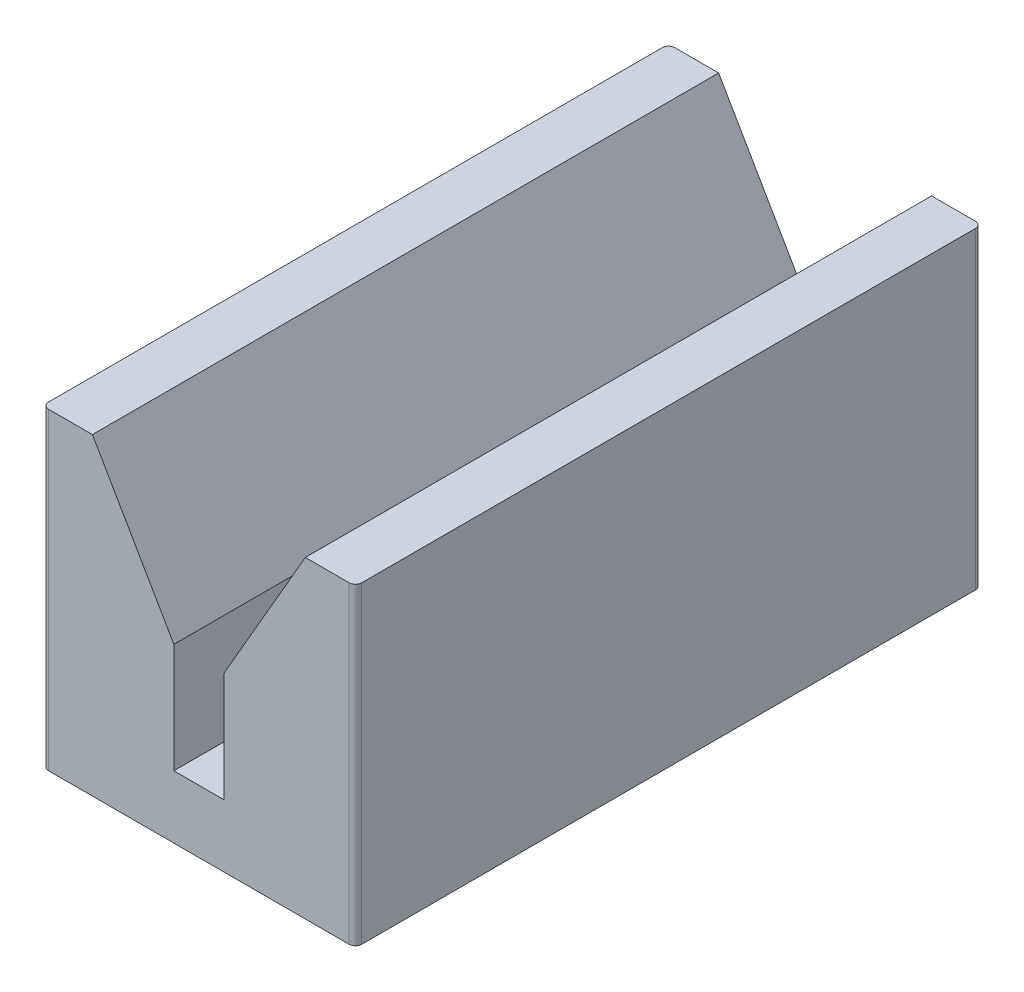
ISO-10303-21;
HEADER;
FILE_DESCRIPTION(('STEP AP214'),'2;1');
FILE_NAME('part.step','',(''),(''),'','','');
FILE_SCHEMA(('AUTOMOTIVE_DESIGN { 1 0 10303 214 1 1 1 1 }'));
ENDSEC;
DATA;
#1=APPLICATION_CONTEXT('core data for automotive mechanical design processes');
#2=APPLICATION_PROTOCOL_DEFINITION('international standard','automotive_design',2000,#1);
#3=PRODUCT_CONTEXT('',#1,'mechanical');
#4=PRODUCT('Part','Part','',(#3));
#5=PRODUCT_RELATED_PRODUCT_CATEGORY('part','',(#4));
#6=PRODUCT_DEFINITION_FORMATION('','',#4);
#7=PRODUCT_DEFINITION_CONTEXT('part definition',#1,'design');
#8=PRODUCT_DEFINITION('design','',#6,#7);
#9=PRODUCT_DEFINITION_SHAPE('','',#8);
#10=(LENGTH_UNIT() NAMED_UNIT(*) SI_UNIT(.MILLI.,.METRE.));
#11=(NAMED_UNIT(*) PLANE_ANGLE_UNIT() SI_UNIT($,.RADIAN.));
#12=(NAMED_UNIT(*) SI_UNIT($,.STERADIAN.) SOLID_ANGLE_UNIT());
#13=UNCERTAINTY_MEASURE_WITH_UNIT(LENGTH_MEASURE(1.E-05),#10,'distance_accuracy_value','');
#14=(GEOMETRIC_REPRESENTATION_CONTEXT(3) GLOBAL_UNCERTAINTY_ASSIGNED_CONTEXT((#13)) GLOBAL_UNIT_ASSIGNED_CONTEXT((#10,
#11,#12)) REPRESENTATION_CONTEXT('',''));
#15=CARTESIAN_POINT('',(0.,0.,0.));
#16=DIRECTION('',(0.,0.,1.));
#17=DIRECTION('',(1.,0.,0.));
#18=AXIS2_PLACEMENT_3D('',#15,#16,#17);
#19=CARTESIAN_POINT('',(0.5,25.,-49.5));
#20=DIRECTION('',(0.,1.,0.));
#21=DIRECTION('',(0.,0.,1.));
#22=AXIS2_PLACEMENT_3D('',#19,#20,#21);
#23=PLANE('',#22);
#24=DIRECTION('',(0.,0.,1.));
#25=VECTOR('',#24,1.);
#26=CARTESIAN_POINT('',(21.0000000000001,24.9999999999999,-50.));
#27=LINE('',#26,#25);
#28=CARTESIAN_POINT('',(21.0000000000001,24.9999999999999,-50.));
#29=VERTEX_POINT('',#28);
#30=CARTESIAN_POINT('',(21.0000000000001,24.9999999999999,0.));
#31=VERTEX_POINT('',#30);
#32=EDGE_CURVE('E215',#29,#31,#27,.T.);
#33=ORIENTED_EDGE('',*,*,#32,.T.);
#34=DIRECTION('',(1.,0.,0.));
#35=VECTOR('',#34,1.);
#36=CARTESIAN_POINT('',(0.500000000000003,25.,0.));
#37=LINE('',#36,#35);
#38=CARTESIAN_POINT('',(24.5,25.,0.));
#39=VERTEX_POINT('',#38);
#40=EDGE_CURVE('E150',#31,#39,#37,.T.);
#41=ORIENTED_EDGE('',*,*,#40,.T.);
#42=CARTESIAN_POINT('',(24.5,25.,-0.5));
#43=DIRECTION('',(0.,1.,0.));
#44=DIRECTION('',(0.,0.,1.));
#45=AXIS2_PLACEMENT_3D('',#42,#43,#44);
#46=CIRCLE('',#45,0.5);
#47=CARTESIAN_POINT('',(25.,25.,-0.500000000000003));
#48=VERTEX_POINT('',#47);
#49=EDGE_CURVE('E149',#39,#48,#46,.T.);
#50=ORIENTED_EDGE('',*,*,#49,.T.);
#51=DIRECTION('',(0.,0.,-1.));
#52=VECTOR('',#51,1.);
#53=CARTESIAN_POINT('',(25.,25.,-49.5));
#54=LINE('',#53,#52);
#55=CARTESIAN_POINT('',(25.,25.,-49.5));
#56=VERTEX_POINT('',#55);
#57=EDGE_CURVE('E152',#48,#56,#54,.T.);
#58=ORIENTED_EDGE('',*,*,#57,.T.);
#59=CARTESIAN_POINT('',(24.5,25.,-49.5));
#60=DIRECTION('',(0.,1.,0.));
#61=DIRECTION('',(0.,0.,-1.));
#62=AXIS2_PLACEMENT_3D('',#59,#60,#61);
#63=CIRCLE('',#62,0.5);
#64=CARTESIAN_POINT('',(24.5,25.,-50.));
#65=VERTEX_POINT('',#64);
#66=EDGE_CURVE('E158',#56,#65,#63,.T.);
#67=ORIENTED_EDGE('',*,*,#66,.T.);
#68=DIRECTION('',(-1.,0.,0.));
#69=VECTOR('',#68,1.);
#70=CARTESIAN_POINT('',(0.500000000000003,25.,-50.));
#71=LINE('',#70,#69);
#72=EDGE_CURVE('E160',#65,#29,#71,.T.);
#73=ORIENTED_EDGE('',*,*,#72,.T.);
#74=EDGE_LOOP('',(#33,#41,#50,#58,#67,#73));
#75=FACE_BOUND('',#74,.T.);
#76=ADVANCED_FACE('F26',(#75),#23,.T.);
#77=CARTESIAN_POINT('',(0.5,25.,-49.5));
#78=DIRECTION('',(0.,-1.,0.));
#79=DIRECTION('',(0.,0.,-1.));
#80=AXIS2_PLACEMENT_3D('',#77,#78,#79);
#81=CYLINDRICAL_SURFACE('',#80,0.5);
#82=CARTESIAN_POINT('',(0.5,0.,-49.5));
#83=DIRECTION('',(0.,1.,0.));
#84=DIRECTION('',(0.,0.,1.));
#85=AXIS2_PLACEMENT_3D('',#82,#83,#84);
#86=CIRCLE('',#85,0.5);
#87=CARTESIAN_POINT('',(0.500000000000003,0.,-50.));
#88=VERTEX_POINT('',#87);
#89=CARTESIAN_POINT('',(0.,0.,-49.5));
#90=VERTEX_POINT('',#89);
#91=EDGE_CURVE('E196',#88,#90,#86,.T.);
#92=ORIENTED_EDGE('',*,*,#91,.T.);
#93=DIRECTION('',(0.,-1.,0.));
#94=VECTOR('',#93,1.);
#95=CARTESIAN_POINT('',(0.,25.,-49.5));
#96=LINE('',#95,#94);
#97=CARTESIAN_POINT('',(0.,25.,-49.5));
#98=VERTEX_POINT('',#97);
#99=EDGE_CURVE('E11',#98,#90,#96,.T.);
#100=ORIENTED_EDGE('',*,*,#99,.F.);
#101=CARTESIAN_POINT('',(0.5,25.,-49.5));
#102=DIRECTION('',(0.,1.,0.));
#103=DIRECTION('',(0.,0.,1.));
#104=AXIS2_PLACEMENT_3D('',#101,#102,#103);
#105=CIRCLE('',#104,0.5);
#106=CARTESIAN_POINT('',(0.500000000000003,25.,-50.));
#107=VERTEX_POINT('',#106);
#108=EDGE_CURVE('E207',#107,#98,#105,.T.);
#109=ORIENTED_EDGE('',*,*,#108,.F.);
#110=DIRECTION('',(0.,-1.,0.));
#111=VECTOR('',#110,1.);
#112=CARTESIAN_POINT('',(0.500000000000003,25.,-50.));
#113=LINE('',#112,#111);
#114=EDGE_CURVE('E163',#107,#88,#113,.T.);
#115=ORIENTED_EDGE('',*,*,#114,.T.);
#116=EDGE_LOOP('',(#92,#100,#109,#115));
#117=FACE_BOUND('',#116,.T.);
#118=ADVANCED_FACE('F28',(#117),#81,.T.);
#119=CARTESIAN_POINT('',(0.,25.,-49.5));
#120=DIRECTION('',(1.,0.,0.));
#121=DIRECTION('',(0.,0.,-1.));
#122=AXIS2_PLACEMENT_3D('',#119,#120,#121);
#123=PLANE('',#122);
#124=DIRECTION('',(0.,0.,1.));
#125=VECTOR('',#124,1.);
#126=CARTESIAN_POINT('',(0.,0.,-49.5));
#127=LINE('',#126,#125);
#128=CARTESIAN_POINT('',(0.,0.,-0.500000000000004));
#129=VERTEX_POINT('',#128);
#130=EDGE_CURVE('E190',#90,#129,#127,.T.);
#131=ORIENTED_EDGE('',*,*,#130,.T.);
#132=DIRECTION('',(0.,-1.,0.));
#133=VECTOR('',#132,1.);
#134=CARTESIAN_POINT('',(0.,25.,-0.500000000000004));
#135=LINE('',#134,#133);
#136=CARTESIAN_POINT('',(0.,25.,-0.500000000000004));
#137=VERTEX_POINT('',#136);
#138=EDGE_CURVE('E34',#137,#129,#135,.T.);
#139=ORIENTED_EDGE('',*,*,#138,.F.);
#140=DIRECTION('',(0.,0.,1.));
#141=VECTOR('',#140,1.);
#142=CARTESIAN_POINT('',(0.,25.,-49.5));
#143=LINE('',#142,#141);
#144=EDGE_CURVE('E208',#98,#137,#143,.T.);
#145=ORIENTED_EDGE('',*,*,#144,.F.);
#146=ORIENTED_EDGE('',*,*,#99,.T.);
#147=EDGE_LOOP('',(#131,#139,#145,#146));
#148=FACE_BOUND('',#147,.T.);
#149=ADVANCED_FACE('F211',(#148),#123,.F.);
#150=CARTESIAN_POINT('',(0.5,25.,-0.5));
#151=DIRECTION('',(0.,-1.,0.));
#152=DIRECTION('',(0.,0.,-1.));
#153=AXIS2_PLACEMENT_3D('',#150,#151,#152);
#154=CYLINDRICAL_SURFACE('',#153,0.5);
#155=CARTESIAN_POINT('',(0.5,0.,-0.5));
#156=DIRECTION('',(0.,1.,0.));
#157=DIRECTION('',(0.,0.,1.));
#158=AXIS2_PLACEMENT_3D('',#155,#156,#157);
#159=CIRCLE('',#158,0.5);
#160=CARTESIAN_POINT('',(0.500000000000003,0.,0.));
#161=VERTEX_POINT('',#160);
#162=EDGE_CURVE('E184',#129,#161,#159,.T.);
#163=ORIENTED_EDGE('',*,*,#162,.T.);
#164=DIRECTION('',(0.,-1.,0.));
#165=VECTOR('',#164,1.);
#166=CARTESIAN_POINT('',(0.500000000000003,25.,0.));
#167=LINE('',#166,#165);
#168=CARTESIAN_POINT('',(0.500000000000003,25.,0.));
#169=VERTEX_POINT('',#168);
#170=EDGE_CURVE('E178',#169,#161,#167,.T.);
#171=ORIENTED_EDGE('',*,*,#170,.F.);
#172=CARTESIAN_POINT('',(0.5,25.,-0.5));
#173=DIRECTION('',(0.,1.,0.));
#174=DIRECTION('',(0.,0.,1.));
#175=AXIS2_PLACEMENT_3D('',#172,#173,#174);
#176=CIRCLE('',#175,0.5);
#177=EDGE_CURVE('E147',#137,#169,#176,.T.);
#178=ORIENTED_EDGE('',*,*,#177,.F.);
#179=ORIENTED_EDGE('',*,*,#138,.T.);
#180=EDGE_LOOP('',(#163,#171,#178,#179));
#181=FACE_BOUND('',#180,.T.);
#182=ADVANCED_FACE('F183',(#181),#154,.T.);
#183=CARTESIAN_POINT('',(0.500000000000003,25.,0.));
#184=DIRECTION('',(0.,0.,-1.));
#185=DIRECTION('',(-1.,0.,0.));
#186=AXIS2_PLACEMENT_3D('',#183,#184,#185);
#187=PLANE('',#186);
#188=ORIENTED_EDGE('',*,*,#40,.F.);
#189=DIRECTION('',(0.499999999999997,0.86602540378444,0.));
#190=VECTOR('',#189,1.);
#191=CARTESIAN_POINT('',(14.5,13.7416697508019,0.));
#192=LINE('',#191,#190);
#193=CARTESIAN_POINT('',(14.5,13.7416697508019,0.));
#194=VERTEX_POINT('',#193);
#195=EDGE_CURVE('E238',#194,#31,#192,.T.);
#196=ORIENTED_EDGE('',*,*,#195,.F.);
#197=DIRECTION('',(0.,1.,0.));
#198=VECTOR('',#197,1.);
#199=CARTESIAN_POINT('',(14.5,5.,0.));
#200=LINE('',#199,#198);
#201=CARTESIAN_POINT('',(14.5,5.,0.));
#202=VERTEX_POINT('',#201);
#203=EDGE_CURVE('E240',#202,#194,#200,.T.);
#204=ORIENTED_EDGE('',*,*,#203,.F.);
#205=DIRECTION('',(1.,0.,0.));
#206=VECTOR('',#205,1.);
#207=CARTESIAN_POINT('',(10.5,5.,0.));
#208=LINE('',#207,#206);
#209=CARTESIAN_POINT('',(10.5,5.,0.));
#210=VERTEX_POINT('',#209);
#211=EDGE_CURVE('E243',#210,#202,#208,.T.);
#212=ORIENTED_EDGE('',*,*,#211,.F.);
#213=DIRECTION('',(0.,-1.,0.));
#214=VECTOR('',#213,1.);
#215=CARTESIAN_POINT('',(10.5,5.,0.));
#216=LINE('',#215,#214);
#217=CARTESIAN_POINT('',(10.5,13.7416697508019,0.));
#218=VERTEX_POINT('',#217);
#219=EDGE_CURVE('E143',#218,#210,#216,.T.);
#220=ORIENTED_EDGE('',*,*,#219,.F.);
#221=DIRECTION('',(0.499999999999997,-0.86602540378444,0.));
#222=VECTOR('',#221,1.);
#223=CARTESIAN_POINT('',(10.5,13.7416697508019,0.));
#224=LINE('',#223,#222);
#225=CARTESIAN_POINT('',(3.99999999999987,24.9999999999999,0.));
#226=VERTEX_POINT('',#225);
#227=EDGE_CURVE('E129',#226,#218,#224,.T.);
#228=ORIENTED_EDGE('',*,*,#227,.F.);
#229=EDGE_CURVE('E140',#169,#226,#37,.T.);
#230=ORIENTED_EDGE('',*,*,#229,.F.);
#231=ORIENTED_EDGE('',*,*,#170,.T.);
#232=DIRECTION('',(1.,0.,0.));
#233=VECTOR('',#232,1.);
#234=CARTESIAN_POINT('',(0.500000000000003,0.,0.));
#235=LINE('',#234,#233);
#236=CARTESIAN_POINT('',(24.5,0.,0.));
#237=VERTEX_POINT('',#236);
#238=EDGE_CURVE('E192',#161,#237,#235,.T.);
#239=ORIENTED_EDGE('',*,*,#238,.T.);
#240=DIRECTION('',(0.,-1.,0.));
#241=VECTOR('',#240,1.);
#242=CARTESIAN_POINT('',(24.5,25.,0.));
#243=LINE('',#242,#241);
#244=EDGE_CURVE('E175',#39,#237,#243,.T.);
#245=ORIENTED_EDGE('',*,*,#244,.F.);
#246=EDGE_LOOP('',(#188,#196,#204,#212,#220,#228,#230,#231,#239,#245));
#247=FACE_BOUND('',#246,.T.);
#248=ADVANCED_FACE('F138',(#247),#187,.F.);
#249=CARTESIAN_POINT('',(24.5,25.,-0.5));
#250=DIRECTION('',(0.,-1.,0.));
#251=DIRECTION('',(0.,0.,-1.));
#252=AXIS2_PLACEMENT_3D('',#249,#250,#251);
#253=CYLINDRICAL_SURFACE('',#252,0.5);
#254=CARTESIAN_POINT('',(24.5,0.,-0.5));
#255=DIRECTION('',(0.,1.,0.));
#256=DIRECTION('',(0.,0.,1.));
#257=AXIS2_PLACEMENT_3D('',#254,#255,#256);
#258=CIRCLE('',#257,0.5);
#259=CARTESIAN_POINT('',(25.,0.,-0.500000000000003));
#260=VERTEX_POINT('',#259);
#261=EDGE_CURVE('E194',#237,#260,#258,.T.);
#262=ORIENTED_EDGE('',*,*,#261,.T.);
#263=DIRECTION('',(0.,-1.,0.));
#264=VECTOR('',#263,1.);
#265=CARTESIAN_POINT('',(25.,25.,-0.500000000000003));
#266=LINE('',#265,#264);
#267=EDGE_CURVE('E172',#48,#260,#266,.T.);
#268=ORIENTED_EDGE('',*,*,#267,.F.);
#269=ORIENTED_EDGE('',*,*,#49,.F.);
#270=ORIENTED_EDGE('',*,*,#244,.T.);
#271=EDGE_LOOP('',(#262,#268,#269,#270));
#272=FACE_BOUND('',#271,.T.);
#273=ADVANCED_FACE('F271',(#272),#253,.T.);
#274=CARTESIAN_POINT('',(25.,25.,-49.5));
#275=DIRECTION('',(-1.,0.,0.));
#276=DIRECTION('',(0.,0.,1.));
#277=AXIS2_PLACEMENT_3D('',#274,#275,#276);
#278=PLANE('',#277);
#279=DIRECTION('',(0.,0.,-1.));
#280=VECTOR('',#279,1.);
#281=CARTESIAN_POINT('',(25.,0.,-49.5));
#282=LINE('',#281,#280);
#283=CARTESIAN_POINT('',(25.,0.,-49.5));
#284=VERTEX_POINT('',#283);
#285=EDGE_CURVE('E201',#260,#284,#282,.T.);
#286=ORIENTED_EDGE('',*,*,#285,.T.);
#287=DIRECTION('',(0.,-1.,0.));
#288=VECTOR('',#287,1.);
#289=CARTESIAN_POINT('',(25.,25.,-49.5));
#290=LINE('',#289,#288);
#291=EDGE_CURVE('E169',#56,#284,#290,.T.);
#292=ORIENTED_EDGE('',*,*,#291,.F.);
#293=ORIENTED_EDGE('',*,*,#57,.F.);
#294=ORIENTED_EDGE('',*,*,#267,.T.);
#295=EDGE_LOOP('',(#286,#292,#293,#294));
#296=FACE_BOUND('',#295,.T.);
#297=ADVANCED_FACE('F267',(#296),#278,.F.);
#298=CARTESIAN_POINT('',(24.5,25.,-49.5));
#299=DIRECTION('',(0.,-1.,0.));
#300=DIRECTION('',(0.,0.,-1.));
#301=AXIS2_PLACEMENT_3D('',#298,#299,#300);
#302=CYLINDRICAL_SURFACE('',#301,0.5);
#303=CARTESIAN_POINT('',(24.5,0.,-49.5));
#304=DIRECTION('',(0.,1.,0.));
#305=DIRECTION('',(0.,0.,-1.));
#306=AXIS2_PLACEMENT_3D('',#303,#304,#305);
#307=CIRCLE('',#306,0.5);
#308=CARTESIAN_POINT('',(24.5,0.,-50.));
#309=VERTEX_POINT('',#308);
#310=EDGE_CURVE('E203',#284,#309,#307,.T.);
#311=ORIENTED_EDGE('',*,*,#310,.T.);
#312=DIRECTION('',(0.,-1.,0.));
#313=VECTOR('',#312,1.);
#314=CARTESIAN_POINT('',(24.5,25.,-50.));
#315=LINE('',#314,#313);
#316=EDGE_CURVE('E166',#65,#309,#315,.T.);
#317=ORIENTED_EDGE('',*,*,#316,.F.);
#318=ORIENTED_EDGE('',*,*,#66,.F.);
#319=ORIENTED_EDGE('',*,*,#291,.T.);
#320=EDGE_LOOP('',(#311,#317,#318,#319));
#321=FACE_BOUND('',#320,.T.);
#322=ADVANCED_FACE('F262',(#321),#302,.T.);
#323=CARTESIAN_POINT('',(0.500000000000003,25.,-50.));
#324=DIRECTION('',(0.,0.,1.));
#325=DIRECTION('',(1.,0.,0.));
#326=AXIS2_PLACEMENT_3D('',#323,#324,#325);
#327=PLANE('',#326);
#328=DIRECTION('',(0.,1.,0.));
#329=VECTOR('',#328,1.);
#330=CARTESIAN_POINT('',(14.5,5.,-50.));
#331=LINE('',#330,#329);
#332=CARTESIAN_POINT('',(14.5,5.,-50.));
#333=VERTEX_POINT('',#332);
#334=CARTESIAN_POINT('',(14.5,13.7416697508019,-50.));
#335=VERTEX_POINT('',#334);
#336=EDGE_CURVE('E228',#333,#335,#331,.T.);
#337=ORIENTED_EDGE('',*,*,#336,.T.);
#338=DIRECTION('',(0.499999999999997,0.86602540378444,0.));
#339=VECTOR('',#338,1.);
#340=CARTESIAN_POINT('',(14.5,13.7416697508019,-50.));
#341=LINE('',#340,#339);
#342=EDGE_CURVE('E133',#335,#29,#341,.T.);
#343=ORIENTED_EDGE('',*,*,#342,.T.);
#344=ORIENTED_EDGE('',*,*,#72,.F.);
#345=ORIENTED_EDGE('',*,*,#316,.T.);
#346=DIRECTION('',(-1.,0.,0.));
#347=VECTOR('',#346,1.);
#348=CARTESIAN_POINT('',(0.500000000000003,0.,-50.));
#349=LINE('',#348,#347);
#350=EDGE_CURVE('E205',#309,#88,#349,.T.);
#351=ORIENTED_EDGE('',*,*,#350,.T.);
#352=ORIENTED_EDGE('',*,*,#114,.F.);
#353=CARTESIAN_POINT('',(3.99999999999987,25.,-50.));
#354=VERTEX_POINT('',#353);
#355=EDGE_CURVE('E48',#354,#107,#71,.T.);
#356=ORIENTED_EDGE('',*,*,#355,.F.);
#357=DIRECTION('',(0.499999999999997,-0.86602540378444,0.));
#358=VECTOR('',#357,1.);
#359=CARTESIAN_POINT('',(10.5,13.7416697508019,-50.));
#360=LINE('',#359,#358);
#361=CARTESIAN_POINT('',(10.5,13.7416697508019,-50.));
#362=VERTEX_POINT('',#361);
#363=EDGE_CURVE('E41',#354,#362,#360,.T.);
#364=ORIENTED_EDGE('',*,*,#363,.T.);
#365=DIRECTION('',(0.,-1.,0.));
#366=VECTOR('',#365,1.);
#367=CARTESIAN_POINT('',(10.5,5.,-50.));
#368=LINE('',#367,#366);
#369=CARTESIAN_POINT('',(10.5,5.,-50.));
#370=VERTEX_POINT('',#369);
#371=EDGE_CURVE('E234',#362,#370,#368,.T.);
#372=ORIENTED_EDGE('',*,*,#371,.T.);
#373=DIRECTION('',(1.,0.,0.));
#374=VECTOR('',#373,1.);
#375=CARTESIAN_POINT('',(10.5,5.,-50.));
#376=LINE('',#375,#374);
#377=EDGE_CURVE('E231',#370,#333,#376,.T.);
#378=ORIENTED_EDGE('',*,*,#377,.T.);
#379=EDGE_LOOP('',(#337,#343,#344,#345,#351,#352,#356,#364,#372,#378));
#380=FACE_BOUND('',#379,.T.);
#381=ADVANCED_FACE('F256',(#380),#327,.F.);
#382=DIRECTION('',(0.,0.,1.));
#383=VECTOR('',#382,1.);
#384=CARTESIAN_POINT('',(3.99999999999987,24.9999999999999,-50.));
#385=LINE('',#384,#383);
#386=EDGE_CURVE('E126',#354,#226,#385,.T.);
#387=ORIENTED_EDGE('',*,*,#386,.F.);
#388=ORIENTED_EDGE('',*,*,#355,.T.);
#389=ORIENTED_EDGE('',*,*,#108,.T.);
#390=ORIENTED_EDGE('',*,*,#144,.T.);
#391=ORIENTED_EDGE('',*,*,#177,.T.);
#392=ORIENTED_EDGE('',*,*,#229,.T.);
#393=EDGE_LOOP('',(#387,#388,#389,#390,#391,#392));
#394=FACE_BOUND('',#393,.T.);
#395=ADVANCED_FACE('F145',(#394),#23,.T.);
#396=CARTESIAN_POINT('',(0.5,0.,-49.5));
#397=DIRECTION('',(0.,1.,0.));
#398=DIRECTION('',(0.,0.,1.));
#399=AXIS2_PLACEMENT_3D('',#396,#397,#398);
#400=PLANE('',#399);
#401=ORIENTED_EDGE('',*,*,#91,.F.);
#402=ORIENTED_EDGE('',*,*,#350,.F.);
#403=ORIENTED_EDGE('',*,*,#310,.F.);
#404=ORIENTED_EDGE('',*,*,#285,.F.);
#405=ORIENTED_EDGE('',*,*,#261,.F.);
#406=ORIENTED_EDGE('',*,*,#238,.F.);
#407=ORIENTED_EDGE('',*,*,#162,.F.);
#408=ORIENTED_EDGE('',*,*,#130,.F.);
#409=EDGE_LOOP('',(#401,#402,#403,#404,#405,#406,#407,#408));
#410=FACE_BOUND('',#409,.T.);
#411=ADVANCED_FACE('F189',(#410),#400,.F.);
#412=CARTESIAN_POINT('',(14.5,13.7416697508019,-50.));
#413=DIRECTION('',(0.86602540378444,-0.499999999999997,0.));
#414=DIRECTION('',(0.499999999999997,0.86602540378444,0.));
#415=AXIS2_PLACEMENT_3D('',#412,#413,#414);
#416=PLANE('',#415);
#417=ORIENTED_EDGE('',*,*,#195,.T.);
#418=ORIENTED_EDGE('',*,*,#32,.F.);
#419=ORIENTED_EDGE('',*,*,#342,.F.);
#420=DIRECTION('',(0.,0.,1.));
#421=VECTOR('',#420,1.);
#422=CARTESIAN_POINT('',(14.5,13.7416697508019,-50.));
#423=LINE('',#422,#421);
#424=EDGE_CURVE('E217',#335,#194,#423,.T.);
#425=ORIENTED_EDGE('',*,*,#424,.T.);
#426=EDGE_LOOP('',(#417,#418,#419,#425));
#427=FACE_BOUND('',#426,.T.);
#428=ADVANCED_FACE('F276',(#427),#416,.F.);
#429=CARTESIAN_POINT('',(14.5,5.,-50.));
#430=DIRECTION('',(1.,0.,0.));
#431=DIRECTION('',(0.,1.,0.));
#432=AXIS2_PLACEMENT_3D('',#429,#430,#431);
#433=PLANE('',#432);
#434=ORIENTED_EDGE('',*,*,#203,.T.);
#435=ORIENTED_EDGE('',*,*,#424,.F.);
#436=ORIENTED_EDGE('',*,*,#336,.F.);
#437=DIRECTION('',(0.,0.,1.));
#438=VECTOR('',#437,1.);
#439=CARTESIAN_POINT('',(14.5,5.,-50.));
#440=LINE('',#439,#438);
#441=EDGE_CURVE('E223',#333,#202,#440,.T.);
#442=ORIENTED_EDGE('',*,*,#441,.T.);
#443=EDGE_LOOP('',(#434,#435,#436,#442));
#444=FACE_BOUND('',#443,.T.);
#445=ADVANCED_FACE('F278',(#444),#433,.F.);
#446=CARTESIAN_POINT('',(10.5,5.,-50.));
#447=DIRECTION('',(0.,-1.,0.));
#448=DIRECTION('',(0.,0.,-1.));
#449=AXIS2_PLACEMENT_3D('',#446,#447,#448);
#450=PLANE('',#449);
#451=ORIENTED_EDGE('',*,*,#211,.T.);
#452=ORIENTED_EDGE('',*,*,#441,.F.);
#453=ORIENTED_EDGE('',*,*,#377,.F.);
#454=DIRECTION('',(0.,0.,1.));
#455=VECTOR('',#454,1.);
#456=CARTESIAN_POINT('',(10.5,5.,-50.));
#457=LINE('',#456,#455);
#458=EDGE_CURVE('E221',#370,#210,#457,.T.);
#459=ORIENTED_EDGE('',*,*,#458,.T.);
#460=EDGE_LOOP('',(#451,#452,#453,#459));
#461=FACE_BOUND('',#460,.T.);
#462=ADVANCED_FACE('F253',(#461),#450,.F.);
#463=CARTESIAN_POINT('',(10.5,5.,-50.));
#464=DIRECTION('',(-1.,0.,0.));
#465=DIRECTION('',(0.,-1.,0.));
#466=AXIS2_PLACEMENT_3D('',#463,#464,#465);
#467=PLANE('',#466);
#468=ORIENTED_EDGE('',*,*,#219,.T.);
#469=ORIENTED_EDGE('',*,*,#458,.F.);
#470=ORIENTED_EDGE('',*,*,#371,.F.);
#471=DIRECTION('',(0.,0.,1.));
#472=VECTOR('',#471,1.);
#473=CARTESIAN_POINT('',(10.5,13.7416697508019,-50.));
#474=LINE('',#473,#472);
#475=EDGE_CURVE('E132',#362,#218,#474,.T.);
#476=ORIENTED_EDGE('',*,*,#475,.T.);
#477=EDGE_LOOP('',(#468,#469,#470,#476));
#478=FACE_BOUND('',#477,.T.);
#479=ADVANCED_FACE('F247',(#478),#467,.F.);
#480=CARTESIAN_POINT('',(10.5,13.7416697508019,-50.));
#481=DIRECTION('',(-0.86602540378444,-0.499999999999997,0.));
#482=DIRECTION('',(0.499999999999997,-0.86602540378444,0.));
#483=AXIS2_PLACEMENT_3D('',#480,#481,#482);
#484=PLANE('',#483);
#485=ORIENTED_EDGE('',*,*,#227,.T.);
#486=ORIENTED_EDGE('',*,*,#475,.F.);
#487=ORIENTED_EDGE('',*,*,#363,.F.);
#488=ORIENTED_EDGE('',*,*,#386,.T.);
#489=EDGE_LOOP('',(#485,#486,#487,#488));
#490=FACE_BOUND('',#489,.T.);
#491=ADVANCED_FACE('F128',(#490),#484,.F.);
#492=CLOSED_SHELL('',(#76,#118,#149,#182,#248,#273,#297,#322,#381,#395,#411,#428,#445,#462,#479,#491));
#493=MANIFOLD_SOLID_BREP('B2',#492);
#494=ADVANCED_BREP_SHAPE_REPRESENTATION('',(#18,#493),#14);
#495=SHAPE_DEFINITION_REPRESENTATION(#9,#494);
ENDSEC;
END-ISO-10303-21;
